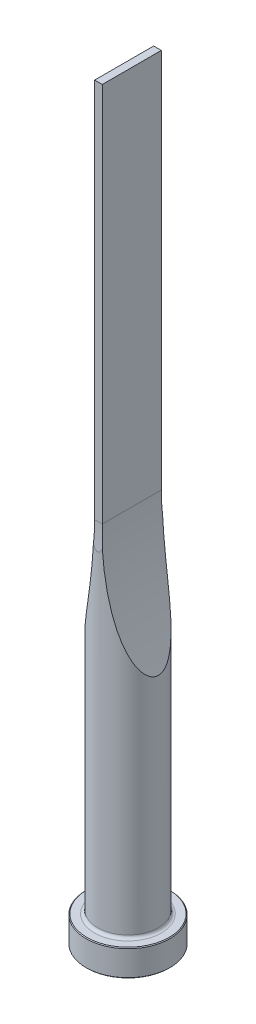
from build123d import *

# Parameters (mm, degrees)
CUT_EXTRUDE1_DEPTH = 10
CUT_EXTRUDE2_DEPTH = 10


with BuildPart() as part:
    # Sketch1 → Revolve1 (revolve)
    with BuildSketch(Plane.XY, mode=Mode.PRIVATE) as revolve1_sk:
        with BuildLine():
            Line((0, 0), (10.8, 0))
            Line((10.8, 0), (11, 0.2))
            Line((11, 0.2), (11, 6.8))
            Line((11, 6.8), (10.8, 7))
            Line((10.8, 7), (8.8, 7))
            ThreePointArc((8.8, 7), (8.234314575, 7.234314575), (8, 7.8))
            Line((8, 7.8), (8, 200))
            Line((8, 200), (0, 200))
            Line((0, 200), (0, 0))
        make_face()
    revolve(revolve1_sk.sketch.rotate(Axis((0, 200, 0), (0, -1, 0)), 180), axis=Axis((0, 200, 0), (0, -1, 0)))

    # Sketch2 → Cut-Extrude1 (cut, symmetric)
    with BuildSketch(Plane.XY):
        with BuildLine():
            Line((1, 200), (1, 100))
            ThreePointArc((1, 100), (2.767352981, 82.251760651), (8, 65.200574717))
            Line((8, 65.200574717), (8, 200))
            Line((8, 200), (1, 200))
        make_face()
        with BuildLine():
            Line((-1, 200), (-1, 100))
            ThreePointArc((-1, 100), (-2.767352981, 82.251760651), (-8, 65.200574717))
            Line((-8, 65.200574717), (-8, 200))
            Line((-8, 200), (-1, 200))
        make_face()
    extrude(amount=CUT_EXTRUDE1_DEPTH, both=True, mode=Mode.SUBTRACT)

    # Sketch3 → Cut-Extrude2 (cut, symmetric)
    with BuildSketch(Plane(origin=(0, 0, 0), x_dir=(0, 0, -1), z_dir=(1, 0, 0))):
        with BuildLine():
            Line((7.75, 200), (7.75, 100))
            ThreePointArc((7.75, 100), (7.812521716, 96.645898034), (8, 93.296456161))
            Line((8, 93.296456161), (8, 200))
            Line((8, 200), (7.75, 200))
        make_face()
        with BuildLine():
            Line((-7.75, 200), (-7.75, 100))
            ThreePointArc((-7.75, 100), (-7.812521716, 96.645898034), (-8, 93.296456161))
            Line((-8, 93.296456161), (-8, 200))
            Line((-8, 200), (-7.75, 200))
        make_face()
    extrude(amount=CUT_EXTRUDE2_DEPTH, both=True, mode=Mode.SUBTRACT)


solid = part.part
